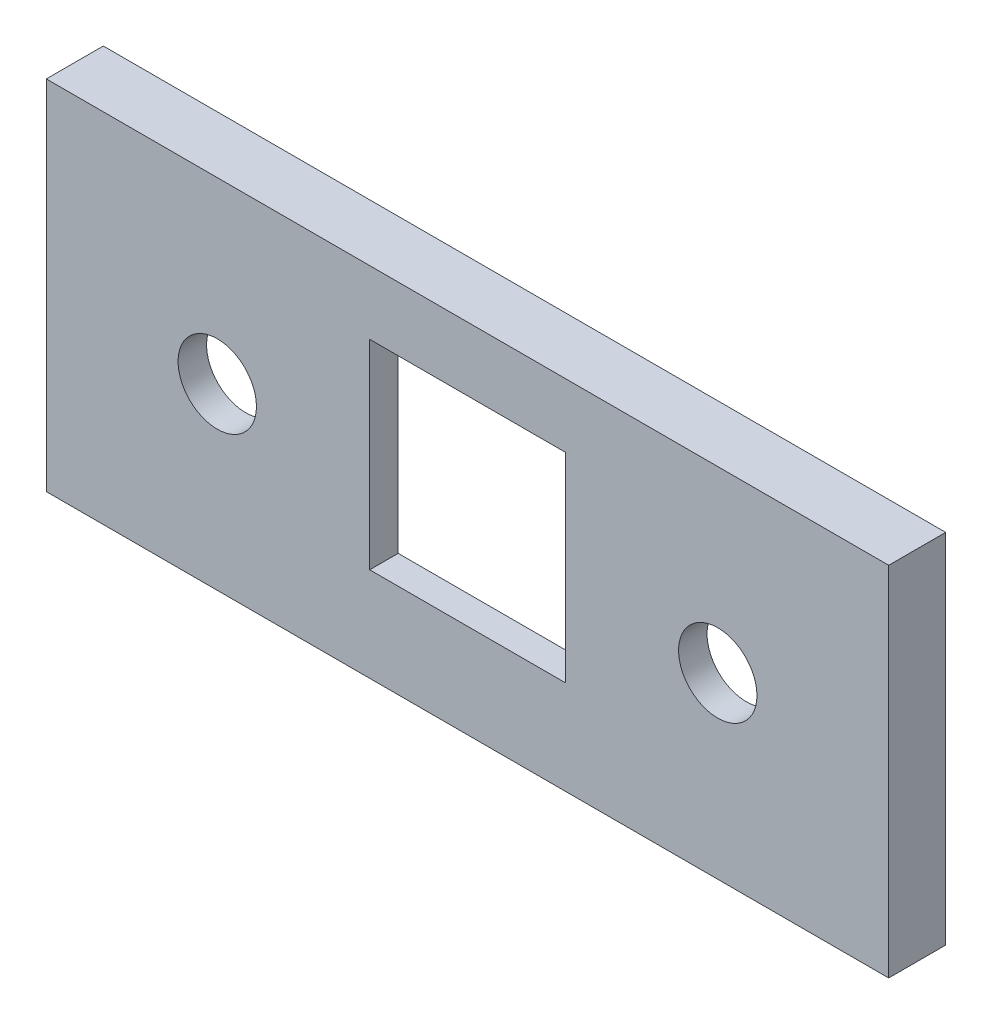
ISO-10303-21;
HEADER;
FILE_DESCRIPTION(('STEP AP214'),'2;1');
FILE_NAME('part.step','',(''),(''),'','','');
FILE_SCHEMA(('AUTOMOTIVE_DESIGN { 1 0 10303 214 1 1 1 1 }'));
ENDSEC;
DATA;
#1=APPLICATION_CONTEXT('core data for automotive mechanical design processes');
#2=APPLICATION_PROTOCOL_DEFINITION('international standard','automotive_design',2000,#1);
#3=PRODUCT_CONTEXT('',#1,'mechanical');
#4=PRODUCT('Part','Part','',(#3));
#5=PRODUCT_RELATED_PRODUCT_CATEGORY('part','',(#4));
#6=PRODUCT_DEFINITION_FORMATION('','',#4);
#7=PRODUCT_DEFINITION_CONTEXT('part definition',#1,'design');
#8=PRODUCT_DEFINITION('design','',#6,#7);
#9=PRODUCT_DEFINITION_SHAPE('','',#8);
#10=(LENGTH_UNIT() NAMED_UNIT(*) SI_UNIT(.MILLI.,.METRE.));
#11=(NAMED_UNIT(*) PLANE_ANGLE_UNIT() SI_UNIT($,.RADIAN.));
#12=(NAMED_UNIT(*) SI_UNIT($,.STERADIAN.) SOLID_ANGLE_UNIT());
#13=UNCERTAINTY_MEASURE_WITH_UNIT(LENGTH_MEASURE(1.E-05),#10,'distance_accuracy_value','');
#14=(GEOMETRIC_REPRESENTATION_CONTEXT(3) GLOBAL_UNCERTAINTY_ASSIGNED_CONTEXT((#13)) GLOBAL_UNIT_ASSIGNED_CONTEXT((#10,
#11,#12)) REPRESENTATION_CONTEXT('',''));
#15=CARTESIAN_POINT('',(0.,0.,0.));
#16=DIRECTION('',(0.,0.,1.));
#17=DIRECTION('',(1.,0.,0.));
#18=AXIS2_PLACEMENT_3D('',#15,#16,#17);
#19=CARTESIAN_POINT('',(3.002,3.002,0.));
#20=DIRECTION('',(0.,0.,-1.));
#21=DIRECTION('',(-1.,0.,0.));
#22=AXIS2_PLACEMENT_3D('',#19,#20,#21);
#23=PLANE('',#22);
#24=DIRECTION('',(-1.,0.,0.));
#25=VECTOR('',#24,1.);
#26=CARTESIAN_POINT('',(20.7005,18.6089168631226,0.));
#27=LINE('',#26,#25);
#28=CARTESIAN_POINT('',(34.4305,18.6089168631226,0.));
#29=VERTEX_POINT('',#28);
#30=CARTESIAN_POINT('',(20.7005,18.6089168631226,0.));
#31=VERTEX_POINT('',#30);
#32=EDGE_CURVE('E246',#29,#31,#27,.T.);
#33=ORIENTED_EDGE('',*,*,#32,.T.);
#34=DIRECTION('',(0.,-1.,0.));
#35=VECTOR('',#34,1.);
#36=CARTESIAN_POINT('',(20.7005,18.6089168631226,0.));
#37=LINE('',#36,#35);
#38=CARTESIAN_POINT('',(20.7005,4.5989168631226,0.));
#39=VERTEX_POINT('',#38);
#40=EDGE_CURVE('E58',#31,#39,#37,.T.);
#41=ORIENTED_EDGE('',*,*,#40,.T.);
#42=DIRECTION('',(1.,0.,0.));
#43=VECTOR('',#42,1.);
#44=CARTESIAN_POINT('',(20.7005,4.5989168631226,0.));
#45=LINE('',#44,#43);
#46=CARTESIAN_POINT('',(34.4305,4.5989168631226,0.));
#47=VERTEX_POINT('',#46);
#48=EDGE_CURVE('E254',#39,#47,#45,.T.);
#49=ORIENTED_EDGE('',*,*,#48,.T.);
#50=DIRECTION('',(0.,1.,0.));
#51=VECTOR('',#50,1.);
#52=CARTESIAN_POINT('',(34.4305,18.6089168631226,0.));
#53=LINE('',#52,#51);
#54=EDGE_CURVE('E257',#47,#29,#53,.T.);
#55=ORIENTED_EDGE('',*,*,#54,.T.);
#56=EDGE_LOOP('',(#33,#41,#49,#55));
#57=FACE_BOUND('',#56,.T.);
#58=CARTESIAN_POINT('',(3.002,3.002,0.));
#59=DIRECTION('',(0.,0.,1.));
#60=DIRECTION('',(-1.,0.,0.));
#61=AXIS2_PLACEMENT_3D('',#58,#59,#60);
#62=CIRCLE('',#61,3.002);
#63=CARTESIAN_POINT('',(0.,3.00200000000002,0.));
#64=VERTEX_POINT('',#63);
#65=CARTESIAN_POINT('',(3.00200000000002,0.,0.));
#66=VERTEX_POINT('',#65);
#67=EDGE_CURVE('E268',#64,#66,#62,.T.);
#68=ORIENTED_EDGE('',*,*,#67,.F.);
#69=DIRECTION('',(0.,-1.,0.));
#70=VECTOR('',#69,1.);
#71=CARTESIAN_POINT('',(0.,3.00200000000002,0.));
#72=LINE('',#71,#70);
#73=CARTESIAN_POINT('',(0.,18.088,0.));
#74=VERTEX_POINT('',#73);
#75=EDGE_CURVE('E11',#74,#64,#72,.T.);
#76=ORIENTED_EDGE('',*,*,#75,.F.);
#77=CARTESIAN_POINT('',(3.002,18.088,0.));
#78=DIRECTION('',(0.,0.,1.));
#79=DIRECTION('',(-1.,0.,0.));
#80=AXIS2_PLACEMENT_3D('',#77,#78,#79);
#81=CIRCLE('',#80,3.002);
#82=CARTESIAN_POINT('',(3.00200000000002,21.09,0.));
#83=VERTEX_POINT('',#82);
#84=EDGE_CURVE('E43',#83,#74,#81,.T.);
#85=ORIENTED_EDGE('',*,*,#84,.F.);
#86=DIRECTION('',(-1.,0.,0.));
#87=VECTOR('',#86,1.);
#88=CARTESIAN_POINT('',(3.00200000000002,21.09,0.));
#89=LINE('',#88,#87);
#90=CARTESIAN_POINT('',(52.129,21.09,0.));
#91=VERTEX_POINT('',#90);
#92=EDGE_CURVE('E282',#91,#83,#89,.T.);
#93=ORIENTED_EDGE('',*,*,#92,.F.);
#94=CARTESIAN_POINT('',(52.129,18.088,0.));
#95=DIRECTION('',(0.,0.,1.));
#96=DIRECTION('',(1.,0.,0.));
#97=AXIS2_PLACEMENT_3D('',#94,#95,#96);
#98=CIRCLE('',#97,3.002);
#99=CARTESIAN_POINT('',(55.131,18.088,0.));
#100=VERTEX_POINT('',#99);
#101=EDGE_CURVE('E279',#100,#91,#98,.T.);
#102=ORIENTED_EDGE('',*,*,#101,.F.);
#103=DIRECTION('',(0.,1.,0.));
#104=VECTOR('',#103,1.);
#105=CARTESIAN_POINT('',(55.131,3.00200000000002,0.));
#106=LINE('',#105,#104);
#107=CARTESIAN_POINT('',(55.131,3.00200000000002,0.));
#108=VERTEX_POINT('',#107);
#109=EDGE_CURVE('E276',#108,#100,#106,.T.);
#110=ORIENTED_EDGE('',*,*,#109,.F.);
#111=CARTESIAN_POINT('',(52.129,3.002,0.));
#112=DIRECTION('',(0.,0.,1.));
#113=DIRECTION('',(-1.,0.,0.));
#114=AXIS2_PLACEMENT_3D('',#111,#112,#113);
#115=CIRCLE('',#114,3.002);
#116=CARTESIAN_POINT('',(52.129,0.,0.));
#117=VERTEX_POINT('',#116);
#118=EDGE_CURVE('E273',#117,#108,#115,.T.);
#119=ORIENTED_EDGE('',*,*,#118,.F.);
#120=DIRECTION('',(1.,0.,0.));
#121=VECTOR('',#120,1.);
#122=CARTESIAN_POINT('',(3.00200000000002,0.,0.));
#123=LINE('',#122,#121);
#124=EDGE_CURVE('E270',#66,#117,#123,.T.);
#125=ORIENTED_EDGE('',*,*,#124,.F.);
#126=EDGE_LOOP('',(#68,#76,#85,#93,#102,#110,#119,#125));
#127=FACE_BOUND('',#126,.T.);
#128=CARTESIAN_POINT('',(10.,10.545,0.));
#129=DIRECTION('',(0.,0.,1.));
#130=DIRECTION('',(1.,0.,0.));
#131=AXIS2_PLACEMENT_3D('',#128,#129,#130);
#132=CIRCLE('',#131,2.75);
#133=CARTESIAN_POINT('',(12.75,10.545,0.));
#134=VERTEX_POINT('',#133);
#135=EDGE_CURVE('E240',#134,#134,#132,.T.);
#136=ORIENTED_EDGE('',*,*,#135,.T.);
#137=EDGE_LOOP('',(#136));
#138=FACE_BOUND('',#137,.T.);
#139=CARTESIAN_POINT('',(45.131,10.545,0.));
#140=DIRECTION('',(0.,0.,1.));
#141=DIRECTION('',(1.,0.,0.));
#142=AXIS2_PLACEMENT_3D('',#139,#140,#141);
#143=CIRCLE('',#142,2.75);
#144=CARTESIAN_POINT('',(47.881,10.545,0.));
#145=VERTEX_POINT('',#144);
#146=EDGE_CURVE('E234',#145,#145,#143,.T.);
#147=ORIENTED_EDGE('',*,*,#146,.T.);
#148=EDGE_LOOP('',(#147));
#149=FACE_BOUND('',#148,.T.);
#150=ADVANCED_FACE('F36',(#57,#127,#138,#149),#23,.T.);
#151=CARTESIAN_POINT('',(3.002,3.002,2.));
#152=DIRECTION('',(0.,0.,-1.));
#153=DIRECTION('',(-1.,0.,0.));
#154=AXIS2_PLACEMENT_3D('',#151,#152,#153);
#155=PLANE('',#154);
#156=CARTESIAN_POINT('',(45.131,10.545,2.));
#157=DIRECTION('',(0.,0.,1.));
#158=DIRECTION('',(1.,0.,0.));
#159=AXIS2_PLACEMENT_3D('',#156,#157,#158);
#160=CIRCLE('',#159,2.75);
#161=CARTESIAN_POINT('',(47.881,10.545,2.));
#162=VERTEX_POINT('',#161);
#163=EDGE_CURVE('E205',#162,#162,#160,.T.);
#164=ORIENTED_EDGE('',*,*,#163,.F.);
#165=EDGE_LOOP('',(#164));
#166=FACE_BOUND('',#165,.T.);
#167=CARTESIAN_POINT('',(10.,10.545,2.));
#168=DIRECTION('',(0.,0.,1.));
#169=DIRECTION('',(1.,0.,0.));
#170=AXIS2_PLACEMENT_3D('',#167,#168,#169);
#171=CIRCLE('',#170,2.75);
#172=CARTESIAN_POINT('',(12.75,10.545,2.));
#173=VERTEX_POINT('',#172);
#174=EDGE_CURVE('E237',#173,#173,#171,.T.);
#175=ORIENTED_EDGE('',*,*,#174,.F.);
#176=EDGE_LOOP('',(#175));
#177=FACE_BOUND('',#176,.T.);
#178=DIRECTION('',(0.,-1.,0.));
#179=VECTOR('',#178,1.);
#180=CARTESIAN_POINT('',(20.7005,18.6089168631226,2.));
#181=LINE('',#180,#179);
#182=CARTESIAN_POINT('',(20.7005,18.6089168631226,2.));
#183=VERTEX_POINT('',#182);
#184=CARTESIAN_POINT('',(20.7005,4.5989168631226,2.));
#185=VERTEX_POINT('',#184);
#186=EDGE_CURVE('E243',#183,#185,#181,.T.);
#187=ORIENTED_EDGE('',*,*,#186,.F.);
#188=DIRECTION('',(-1.,0.,0.));
#189=VECTOR('',#188,1.);
#190=CARTESIAN_POINT('',(20.7005,18.6089168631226,2.));
#191=LINE('',#190,#189);
#192=CARTESIAN_POINT('',(34.4305,18.6089168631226,2.));
#193=VERTEX_POINT('',#192);
#194=EDGE_CURVE('E250',#193,#183,#191,.T.);
#195=ORIENTED_EDGE('',*,*,#194,.F.);
#196=DIRECTION('',(0.,1.,0.));
#197=VECTOR('',#196,1.);
#198=CARTESIAN_POINT('',(34.4305,18.6089168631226,2.));
#199=LINE('',#198,#197);
#200=CARTESIAN_POINT('',(34.4305,4.5989168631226,2.));
#201=VERTEX_POINT('',#200);
#202=EDGE_CURVE('E248',#201,#193,#199,.T.);
#203=ORIENTED_EDGE('',*,*,#202,.F.);
#204=DIRECTION('',(1.,0.,0.));
#205=VECTOR('',#204,1.);
#206=CARTESIAN_POINT('',(20.7005,4.5989168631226,2.));
#207=LINE('',#206,#205);
#208=EDGE_CURVE('E245',#185,#201,#207,.T.);
#209=ORIENTED_EDGE('',*,*,#208,.F.);
#210=EDGE_LOOP('',(#187,#195,#203,#209));
#211=FACE_BOUND('',#210,.T.);
#212=DIRECTION('',(0.,1.,0.));
#213=VECTOR('',#212,1.);
#214=CARTESIAN_POINT('',(57.131,23.09,2.));
#215=LINE('',#214,#213);
#216=CARTESIAN_POINT('',(57.131,-2.,2.));
#217=VERTEX_POINT('',#216);
#218=CARTESIAN_POINT('',(57.131,23.09,2.));
#219=VERTEX_POINT('',#218);
#220=EDGE_CURVE('E206',#217,#219,#215,.T.);
#221=ORIENTED_EDGE('',*,*,#220,.T.);
#222=DIRECTION('',(-1.,0.,0.));
#223=VECTOR('',#222,1.);
#224=CARTESIAN_POINT('',(57.131,23.09,2.));
#225=LINE('',#224,#223);
#226=CARTESIAN_POINT('',(-2.,23.09,2.));
#227=VERTEX_POINT('',#226);
#228=EDGE_CURVE('E209',#219,#227,#225,.T.);
#229=ORIENTED_EDGE('',*,*,#228,.T.);
#230=DIRECTION('',(0.,-1.,0.));
#231=VECTOR('',#230,1.);
#232=CARTESIAN_POINT('',(-2.,23.09,2.));
#233=LINE('',#232,#231);
#234=CARTESIAN_POINT('',(-2.,-2.,2.));
#235=VERTEX_POINT('',#234);
#236=EDGE_CURVE('E207',#227,#235,#233,.T.);
#237=ORIENTED_EDGE('',*,*,#236,.T.);
#238=DIRECTION('',(1.,0.,0.));
#239=VECTOR('',#238,1.);
#240=CARTESIAN_POINT('',(57.131,-2.,2.));
#241=LINE('',#240,#239);
#242=EDGE_CURVE('E203',#235,#217,#241,.T.);
#243=ORIENTED_EDGE('',*,*,#242,.T.);
#244=EDGE_LOOP('',(#221,#229,#237,#243));
#245=FACE_BOUND('',#244,.T.);
#246=ADVANCED_FACE('F317',(#166,#177,#211,#245),#155,.F.);
#247=CARTESIAN_POINT('',(20.7005,18.6089168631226,2.));
#248=DIRECTION('',(1.,0.,0.));
#249=DIRECTION('',(0.,0.,-1.));
#250=AXIS2_PLACEMENT_3D('',#247,#248,#249);
#251=PLANE('',#250);
#252=ORIENTED_EDGE('',*,*,#40,.F.);
#253=DIRECTION('',(0.,0.,-1.));
#254=VECTOR('',#253,1.);
#255=CARTESIAN_POINT('',(20.7005,18.6089168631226,2.));
#256=LINE('',#255,#254);
#257=EDGE_CURVE('E252',#183,#31,#256,.T.);
#258=ORIENTED_EDGE('',*,*,#257,.F.);
#259=ORIENTED_EDGE('',*,*,#186,.T.);
#260=DIRECTION('',(0.,0.,-1.));
#261=VECTOR('',#260,1.);
#262=CARTESIAN_POINT('',(20.7005,4.5989168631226,2.));
#263=LINE('',#262,#261);
#264=EDGE_CURVE('E266',#185,#39,#263,.T.);
#265=ORIENTED_EDGE('',*,*,#264,.T.);
#266=EDGE_LOOP('',(#252,#258,#259,#265));
#267=FACE_BOUND('',#266,.T.);
#268=ADVANCED_FACE('F322',(#267),#251,.T.);
#269=CARTESIAN_POINT('',(20.7005,4.5989168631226,2.));
#270=DIRECTION('',(0.,1.,0.));
#271=DIRECTION('',(0.,0.,1.));
#272=AXIS2_PLACEMENT_3D('',#269,#270,#271);
#273=PLANE('',#272);
#274=ORIENTED_EDGE('',*,*,#48,.F.);
#275=ORIENTED_EDGE('',*,*,#264,.F.);
#276=ORIENTED_EDGE('',*,*,#208,.T.);
#277=DIRECTION('',(0.,0.,-1.));
#278=VECTOR('',#277,1.);
#279=CARTESIAN_POINT('',(34.4305,4.5989168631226,2.));
#280=LINE('',#279,#278);
#281=EDGE_CURVE('E264',#201,#47,#280,.T.);
#282=ORIENTED_EDGE('',*,*,#281,.T.);
#283=EDGE_LOOP('',(#274,#275,#276,#282));
#284=FACE_BOUND('',#283,.T.);
#285=ADVANCED_FACE('F335',(#284),#273,.T.);
#286=CARTESIAN_POINT('',(34.4305,18.6089168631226,2.));
#287=DIRECTION('',(-1.,0.,0.));
#288=DIRECTION('',(0.,0.,1.));
#289=AXIS2_PLACEMENT_3D('',#286,#287,#288);
#290=PLANE('',#289);
#291=ORIENTED_EDGE('',*,*,#54,.F.);
#292=ORIENTED_EDGE('',*,*,#281,.F.);
#293=ORIENTED_EDGE('',*,*,#202,.T.);
#294=DIRECTION('',(0.,0.,-1.));
#295=VECTOR('',#294,1.);
#296=CARTESIAN_POINT('',(34.4305,18.6089168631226,2.));
#297=LINE('',#296,#295);
#298=EDGE_CURVE('E50',#193,#29,#297,.T.);
#299=ORIENTED_EDGE('',*,*,#298,.T.);
#300=EDGE_LOOP('',(#291,#292,#293,#299));
#301=FACE_BOUND('',#300,.T.);
#302=ADVANCED_FACE('F337',(#301),#290,.T.);
#303=CARTESIAN_POINT('',(20.7005,18.6089168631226,2.));
#304=DIRECTION('',(0.,-1.,0.));
#305=DIRECTION('',(0.,0.,-1.));
#306=AXIS2_PLACEMENT_3D('',#303,#304,#305);
#307=PLANE('',#306);
#308=ORIENTED_EDGE('',*,*,#32,.F.);
#309=ORIENTED_EDGE('',*,*,#298,.F.);
#310=ORIENTED_EDGE('',*,*,#194,.T.);
#311=ORIENTED_EDGE('',*,*,#257,.T.);
#312=EDGE_LOOP('',(#308,#309,#310,#311));
#313=FACE_BOUND('',#312,.T.);
#314=ADVANCED_FACE('F325',(#313),#307,.T.);
#315=CARTESIAN_POINT('',(10.,10.545,2.));
#316=DIRECTION('',(0.,0.,1.));
#317=DIRECTION('',(1.,0.,0.));
#318=AXIS2_PLACEMENT_3D('',#315,#316,#317);
#319=CYLINDRICAL_SURFACE('',#318,2.75);
#320=ORIENTED_EDGE('',*,*,#135,.F.);
#321=EDGE_LOOP('',(#320));
#322=FACE_BOUND('',#321,.T.);
#323=ORIENTED_EDGE('',*,*,#174,.T.);
#324=EDGE_LOOP('',(#323));
#325=FACE_BOUND('',#324,.T.);
#326=ADVANCED_FACE('F344',(#322,#325),#319,.F.);
#327=CARTESIAN_POINT('',(45.131,10.545,2.));
#328=DIRECTION('',(0.,0.,1.));
#329=DIRECTION('',(1.,0.,0.));
#330=AXIS2_PLACEMENT_3D('',#327,#328,#329);
#331=CYLINDRICAL_SURFACE('',#330,2.75);
#332=ORIENTED_EDGE('',*,*,#146,.F.);
#333=EDGE_LOOP('',(#332));
#334=FACE_BOUND('',#333,.T.);
#335=ORIENTED_EDGE('',*,*,#163,.T.);
#336=EDGE_LOOP('',(#335));
#337=FACE_BOUND('',#336,.T.);
#338=ADVANCED_FACE('F377',(#334,#337),#331,.F.);
#339=CARTESIAN_POINT('',(57.131,-2.,66.2338171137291));
#340=DIRECTION('',(0.,-1.,0.));
#341=DIRECTION('',(0.,0.,-1.));
#342=AXIS2_PLACEMENT_3D('',#339,#340,#341);
#343=PLANE('',#342);
#344=ORIENTED_EDGE('',*,*,#242,.F.);
#345=DIRECTION('',(0.,0.,-1.));
#346=VECTOR('',#345,1.);
#347=CARTESIAN_POINT('',(-2.,-2.,66.2338171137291));
#348=LINE('',#347,#346);
#349=CARTESIAN_POINT('',(-2.,-2.,-2.));
#350=VERTEX_POINT('',#349);
#351=EDGE_CURVE('E229',#235,#350,#348,.T.);
#352=ORIENTED_EDGE('',*,*,#351,.T.);
#353=DIRECTION('',(-1.,0.,0.));
#354=VECTOR('',#353,1.);
#355=CARTESIAN_POINT('',(57.131,-2.,-2.));
#356=LINE('',#355,#354);
#357=CARTESIAN_POINT('',(57.131,-2.,-2.));
#358=VERTEX_POINT('',#357);
#359=EDGE_CURVE('E195',#358,#350,#356,.T.);
#360=ORIENTED_EDGE('',*,*,#359,.F.);
#361=DIRECTION('',(0.,0.,-1.));
#362=VECTOR('',#361,1.);
#363=CARTESIAN_POINT('',(57.131,-2.,66.2338171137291));
#364=LINE('',#363,#362);
#365=EDGE_CURVE('E214',#217,#358,#364,.T.);
#366=ORIENTED_EDGE('',*,*,#365,.F.);
#367=EDGE_LOOP('',(#344,#352,#360,#366));
#368=FACE_BOUND('',#367,.T.);
#369=ADVANCED_FACE('F386',(#368),#343,.T.);
#370=CARTESIAN_POINT('',(-2.,23.09,66.2338171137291));
#371=DIRECTION('',(-1.,0.,0.));
#372=DIRECTION('',(0.,0.,1.));
#373=AXIS2_PLACEMENT_3D('',#370,#371,#372);
#374=PLANE('',#373);
#375=ORIENTED_EDGE('',*,*,#236,.F.);
#376=DIRECTION('',(0.,0.,-1.));
#377=VECTOR('',#376,1.);
#378=CARTESIAN_POINT('',(-2.,23.09,66.2338171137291));
#379=LINE('',#378,#377);
#380=CARTESIAN_POINT('',(-2.,23.09,-2.));
#381=VERTEX_POINT('',#380);
#382=EDGE_CURVE('E227',#227,#381,#379,.T.);
#383=ORIENTED_EDGE('',*,*,#382,.T.);
#384=DIRECTION('',(0.,1.,0.));
#385=VECTOR('',#384,1.);
#386=CARTESIAN_POINT('',(-2.,23.09,-2.));
#387=LINE('',#386,#385);
#388=EDGE_CURVE('E198',#350,#381,#387,.T.);
#389=ORIENTED_EDGE('',*,*,#388,.F.);
#390=ORIENTED_EDGE('',*,*,#351,.F.);
#391=EDGE_LOOP('',(#375,#383,#389,#390));
#392=FACE_BOUND('',#391,.T.);
#393=ADVANCED_FACE('F405',(#392),#374,.T.);
#394=CARTESIAN_POINT('',(57.131,23.09,66.2338171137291));
#395=DIRECTION('',(0.,1.,0.));
#396=DIRECTION('',(0.,0.,1.));
#397=AXIS2_PLACEMENT_3D('',#394,#395,#396);
#398=PLANE('',#397);
#399=ORIENTED_EDGE('',*,*,#228,.F.);
#400=DIRECTION('',(0.,0.,-1.));
#401=VECTOR('',#400,1.);
#402=CARTESIAN_POINT('',(57.131,23.09,66.2338171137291));
#403=LINE('',#402,#401);
#404=CARTESIAN_POINT('',(57.131,23.09,-2.));
#405=VERTEX_POINT('',#404);
#406=EDGE_CURVE('E210',#219,#405,#403,.T.);
#407=ORIENTED_EDGE('',*,*,#406,.T.);
#408=DIRECTION('',(1.,0.,0.));
#409=VECTOR('',#408,1.);
#410=CARTESIAN_POINT('',(57.131,23.09,-2.));
#411=LINE('',#410,#409);
#412=EDGE_CURVE('E160',#381,#405,#411,.T.);
#413=ORIENTED_EDGE('',*,*,#412,.F.);
#414=ORIENTED_EDGE('',*,*,#382,.F.);
#415=EDGE_LOOP('',(#399,#407,#413,#414));
#416=FACE_BOUND('',#415,.T.);
#417=ADVANCED_FACE('F415',(#416),#398,.T.);
#418=CARTESIAN_POINT('',(57.131,23.09,66.2338171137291));
#419=DIRECTION('',(1.,0.,0.));
#420=DIRECTION('',(0.,0.,-1.));
#421=AXIS2_PLACEMENT_3D('',#418,#419,#420);
#422=PLANE('',#421);
#423=ORIENTED_EDGE('',*,*,#220,.F.);
#424=ORIENTED_EDGE('',*,*,#365,.T.);
#425=DIRECTION('',(0.,-1.,0.));
#426=VECTOR('',#425,1.);
#427=CARTESIAN_POINT('',(57.131,23.09,-2.));
#428=LINE('',#427,#426);
#429=EDGE_CURVE('E192',#405,#358,#428,.T.);
#430=ORIENTED_EDGE('',*,*,#429,.F.);
#431=ORIENTED_EDGE('',*,*,#406,.F.);
#432=EDGE_LOOP('',(#423,#424,#430,#431));
#433=FACE_BOUND('',#432,.T.);
#434=ADVANCED_FACE('F425',(#433),#422,.T.);
#435=CARTESIAN_POINT('',(0.,18.088,66.2338171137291));
#436=DIRECTION('',(-1.,0.,0.));
#437=DIRECTION('',(0.,-1.,0.));
#438=AXIS2_PLACEMENT_3D('',#435,#436,#437);
#439=PLANE('',#438);
#440=ORIENTED_EDGE('',*,*,#75,.T.);
#441=DIRECTION('',(0.,0.,-1.));
#442=VECTOR('',#441,1.);
#443=CARTESIAN_POINT('',(0.,3.00200000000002,66.2338171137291));
#444=LINE('',#443,#442);
#445=CARTESIAN_POINT('',(0.,3.00200000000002,-2.));
#446=VERTEX_POINT('',#445);
#447=EDGE_CURVE('E150',#64,#446,#444,.T.);
#448=ORIENTED_EDGE('',*,*,#447,.T.);
#449=DIRECTION('',(0.,1.,0.));
#450=VECTOR('',#449,1.);
#451=CARTESIAN_POINT('',(0.,18.088,-2.));
#452=LINE('',#451,#450);
#453=CARTESIAN_POINT('',(0.,18.088,-2.));
#454=VERTEX_POINT('',#453);
#455=EDGE_CURVE('E155',#446,#454,#452,.T.);
#456=ORIENTED_EDGE('',*,*,#455,.T.);
#457=DIRECTION('',(0.,0.,-1.));
#458=VECTOR('',#457,1.);
#459=CARTESIAN_POINT('',(0.,18.088,66.2338171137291));
#460=LINE('',#459,#458);
#461=EDGE_CURVE('E159',#74,#454,#460,.T.);
#462=ORIENTED_EDGE('',*,*,#461,.F.);
#463=EDGE_LOOP('',(#440,#448,#456,#462));
#464=FACE_BOUND('',#463,.T.);
#465=ADVANCED_FACE('F152',(#464),#439,.F.);
#466=CARTESIAN_POINT('',(3.002,18.088,66.2338171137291));
#467=DIRECTION('',(0.,0.,-1.));
#468=DIRECTION('',(-1.,0.,0.));
#469=AXIS2_PLACEMENT_3D('',#466,#467,#468);
#470=CYLINDRICAL_SURFACE('',#469,3.002);
#471=ORIENTED_EDGE('',*,*,#84,.T.);
#472=ORIENTED_EDGE('',*,*,#461,.T.);
#473=CARTESIAN_POINT('',(3.002,18.088,-2.));
#474=DIRECTION('',(0.,0.,-1.));
#475=DIRECTION('',(-1.,0.,0.));
#476=AXIS2_PLACEMENT_3D('',#473,#474,#475);
#477=CIRCLE('',#476,3.002);
#478=CARTESIAN_POINT('',(3.00200000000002,21.09,-2.));
#479=VERTEX_POINT('',#478);
#480=EDGE_CURVE('E174',#454,#479,#477,.T.);
#481=ORIENTED_EDGE('',*,*,#480,.T.);
#482=DIRECTION('',(0.,0.,-1.));
#483=VECTOR('',#482,1.);
#484=CARTESIAN_POINT('',(3.00200000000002,21.09,66.2338171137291));
#485=LINE('',#484,#483);
#486=EDGE_CURVE('E223',#83,#479,#485,.T.);
#487=ORIENTED_EDGE('',*,*,#486,.F.);
#488=EDGE_LOOP('',(#471,#472,#481,#487));
#489=FACE_BOUND('',#488,.T.);
#490=ADVANCED_FACE('F287',(#489),#470,.F.);
#491=CARTESIAN_POINT('',(3.00200000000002,21.09,66.2338171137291));
#492=DIRECTION('',(0.,1.,0.));
#493=DIRECTION('',(-1.,0.,0.));
#494=AXIS2_PLACEMENT_3D('',#491,#492,#493);
#495=PLANE('',#494);
#496=ORIENTED_EDGE('',*,*,#92,.T.);
#497=ORIENTED_EDGE('',*,*,#486,.T.);
#498=DIRECTION('',(1.,0.,0.));
#499=VECTOR('',#498,1.);
#500=CARTESIAN_POINT('',(3.00200000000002,21.09,-2.));
#501=LINE('',#500,#499);
#502=CARTESIAN_POINT('',(52.129,21.09,-2.));
#503=VERTEX_POINT('',#502);
#504=EDGE_CURVE('E176',#479,#503,#501,.T.);
#505=ORIENTED_EDGE('',*,*,#504,.T.);
#506=DIRECTION('',(0.,0.,-1.));
#507=VECTOR('',#506,1.);
#508=CARTESIAN_POINT('',(52.129,21.09,66.2338171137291));
#509=LINE('',#508,#507);
#510=EDGE_CURVE('E221',#91,#503,#509,.T.);
#511=ORIENTED_EDGE('',*,*,#510,.F.);
#512=EDGE_LOOP('',(#496,#497,#505,#511));
#513=FACE_BOUND('',#512,.T.);
#514=ADVANCED_FACE('F292',(#513),#495,.F.);
#515=CARTESIAN_POINT('',(52.129,18.088,66.2338171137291));
#516=DIRECTION('',(0.,0.,-1.));
#517=DIRECTION('',(-1.,0.,0.));
#518=AXIS2_PLACEMENT_3D('',#515,#516,#517);
#519=CYLINDRICAL_SURFACE('',#518,3.002);
#520=ORIENTED_EDGE('',*,*,#101,.T.);
#521=ORIENTED_EDGE('',*,*,#510,.T.);
#522=CARTESIAN_POINT('',(52.129,18.088,-2.));
#523=DIRECTION('',(0.,0.,-1.));
#524=DIRECTION('',(1.,0.,0.));
#525=AXIS2_PLACEMENT_3D('',#522,#523,#524);
#526=CIRCLE('',#525,3.002);
#527=CARTESIAN_POINT('',(55.131,18.088,-2.));
#528=VERTEX_POINT('',#527);
#529=EDGE_CURVE('E181',#503,#528,#526,.T.);
#530=ORIENTED_EDGE('',*,*,#529,.T.);
#531=DIRECTION('',(0.,0.,-1.));
#532=VECTOR('',#531,1.);
#533=CARTESIAN_POINT('',(55.131,18.088,66.2338171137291));
#534=LINE('',#533,#532);
#535=EDGE_CURVE('E219',#100,#528,#534,.T.);
#536=ORIENTED_EDGE('',*,*,#535,.F.);
#537=EDGE_LOOP('',(#520,#521,#530,#536));
#538=FACE_BOUND('',#537,.T.);
#539=ADVANCED_FACE('F295',(#538),#519,.F.);
#540=CARTESIAN_POINT('',(55.131,18.088,66.2338171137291));
#541=DIRECTION('',(1.,0.,0.));
#542=DIRECTION('',(0.,0.,-1.));
#543=AXIS2_PLACEMENT_3D('',#540,#541,#542);
#544=PLANE('',#543);
#545=ORIENTED_EDGE('',*,*,#109,.T.);
#546=ORIENTED_EDGE('',*,*,#535,.T.);
#547=DIRECTION('',(0.,-1.,0.));
#548=VECTOR('',#547,1.);
#549=CARTESIAN_POINT('',(55.131,18.088,-2.));
#550=LINE('',#549,#548);
#551=CARTESIAN_POINT('',(55.131,3.00200000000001,-2.));
#552=VERTEX_POINT('',#551);
#553=EDGE_CURVE('E184',#528,#552,#550,.T.);
#554=ORIENTED_EDGE('',*,*,#553,.T.);
#555=DIRECTION('',(0.,0.,-1.));
#556=VECTOR('',#555,1.);
#557=CARTESIAN_POINT('',(55.131,3.00200000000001,66.2338171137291));
#558=LINE('',#557,#556);
#559=EDGE_CURVE('E217',#108,#552,#558,.T.);
#560=ORIENTED_EDGE('',*,*,#559,.F.);
#561=EDGE_LOOP('',(#545,#546,#554,#560));
#562=FACE_BOUND('',#561,.T.);
#563=ADVANCED_FACE('F300',(#562),#544,.F.);
#564=CARTESIAN_POINT('',(52.129,3.00199999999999,66.2338171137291));
#565=DIRECTION('',(0.,0.,-1.));
#566=DIRECTION('',(-1.,0.,0.));
#567=AXIS2_PLACEMENT_3D('',#564,#565,#566);
#568=CYLINDRICAL_SURFACE('',#567,3.002);
#569=ORIENTED_EDGE('',*,*,#118,.T.);
#570=ORIENTED_EDGE('',*,*,#559,.T.);
#571=CARTESIAN_POINT('',(52.129,3.00199999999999,-2.));
#572=DIRECTION('',(0.,0.,-1.));
#573=DIRECTION('',(1.,0.,0.));
#574=AXIS2_PLACEMENT_3D('',#571,#572,#573);
#575=CIRCLE('',#574,3.002);
#576=CARTESIAN_POINT('',(52.129,0.,-2.));
#577=VERTEX_POINT('',#576);
#578=EDGE_CURVE('E187',#552,#577,#575,.T.);
#579=ORIENTED_EDGE('',*,*,#578,.T.);
#580=DIRECTION('',(0.,0.,-1.));
#581=VECTOR('',#580,1.);
#582=CARTESIAN_POINT('',(52.129,0.,66.2338171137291));
#583=LINE('',#582,#581);
#584=EDGE_CURVE('E215',#117,#577,#583,.T.);
#585=ORIENTED_EDGE('',*,*,#584,.F.);
#586=EDGE_LOOP('',(#569,#570,#579,#585));
#587=FACE_BOUND('',#586,.T.);
#588=ADVANCED_FACE('F303',(#587),#568,.F.);
#589=CARTESIAN_POINT('',(3.00200000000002,0.,66.2338171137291));
#590=DIRECTION('',(0.,-1.,0.));
#591=DIRECTION('',(1.,0.,0.));
#592=AXIS2_PLACEMENT_3D('',#589,#590,#591);
#593=PLANE('',#592);
#594=ORIENTED_EDGE('',*,*,#124,.T.);
#595=ORIENTED_EDGE('',*,*,#584,.T.);
#596=DIRECTION('',(-1.,0.,0.));
#597=VECTOR('',#596,1.);
#598=CARTESIAN_POINT('',(3.00200000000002,0.,-2.));
#599=LINE('',#598,#597);
#600=CARTESIAN_POINT('',(3.00200000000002,0.,-2.));
#601=VERTEX_POINT('',#600);
#602=EDGE_CURVE('E190',#577,#601,#599,.T.);
#603=ORIENTED_EDGE('',*,*,#602,.T.);
#604=DIRECTION('',(0.,0.,-1.));
#605=VECTOR('',#604,1.);
#606=CARTESIAN_POINT('',(3.00200000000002,0.,66.2338171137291));
#607=LINE('',#606,#605);
#608=EDGE_CURVE('E166',#66,#601,#607,.T.);
#609=ORIENTED_EDGE('',*,*,#608,.F.);
#610=EDGE_LOOP('',(#594,#595,#603,#609));
#611=FACE_BOUND('',#610,.T.);
#612=ADVANCED_FACE('F306',(#611),#593,.F.);
#613=CARTESIAN_POINT('',(3.002,3.002,66.2338171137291));
#614=DIRECTION('',(0.,0.,-1.));
#615=DIRECTION('',(-1.,0.,0.));
#616=AXIS2_PLACEMENT_3D('',#613,#614,#615);
#617=CYLINDRICAL_SURFACE('',#616,3.002);
#618=ORIENTED_EDGE('',*,*,#67,.T.);
#619=ORIENTED_EDGE('',*,*,#608,.T.);
#620=CARTESIAN_POINT('',(3.002,3.002,-2.));
#621=DIRECTION('',(0.,0.,-1.));
#622=DIRECTION('',(1.,0.,0.));
#623=AXIS2_PLACEMENT_3D('',#620,#621,#622);
#624=CIRCLE('',#623,3.002);
#625=EDGE_CURVE('E163',#601,#446,#624,.T.);
#626=ORIENTED_EDGE('',*,*,#625,.T.);
#627=ORIENTED_EDGE('',*,*,#447,.F.);
#628=EDGE_LOOP('',(#618,#619,#626,#627));
#629=FACE_BOUND('',#628,.T.);
#630=ADVANCED_FACE('F164',(#629),#617,.F.);
#631=CARTESIAN_POINT('',(0.,0.,-2.));
#632=DIRECTION('',(0.,0.,-1.));
#633=DIRECTION('',(-1.,0.,0.));
#634=AXIS2_PLACEMENT_3D('',#631,#632,#633);
#635=PLANE('',#634);
#636=ORIENTED_EDGE('',*,*,#429,.T.);
#637=ORIENTED_EDGE('',*,*,#359,.T.);
#638=ORIENTED_EDGE('',*,*,#388,.T.);
#639=ORIENTED_EDGE('',*,*,#412,.T.);
#640=EDGE_LOOP('',(#636,#637,#638,#639));
#641=FACE_BOUND('',#640,.T.);
#642=ORIENTED_EDGE('',*,*,#455,.F.);
#643=ORIENTED_EDGE('',*,*,#625,.F.);
#644=ORIENTED_EDGE('',*,*,#602,.F.);
#645=ORIENTED_EDGE('',*,*,#578,.F.);
#646=ORIENTED_EDGE('',*,*,#553,.F.);
#647=ORIENTED_EDGE('',*,*,#529,.F.);
#648=ORIENTED_EDGE('',*,*,#504,.F.);
#649=ORIENTED_EDGE('',*,*,#480,.F.);
#650=EDGE_LOOP('',(#642,#643,#644,#645,#646,#647,#648,#649));
#651=FACE_BOUND('',#650,.T.);
#652=ADVANCED_FACE('F171',(#641,#651),#635,.T.);
#653=CLOSED_SHELL('',(#150,#246,#268,#285,#302,#314,#326,#338,#369,#393,#417,#434,#465,#490,
#514,#539,#563,#588,#612,#630,#652));
#654=MANIFOLD_SOLID_BREP('B2',#653);
#655=ADVANCED_BREP_SHAPE_REPRESENTATION('',(#18,#654),#14);
#656=SHAPE_DEFINITION_REPRESENTATION(#9,#655);
ENDSEC;
END-ISO-10303-21;
